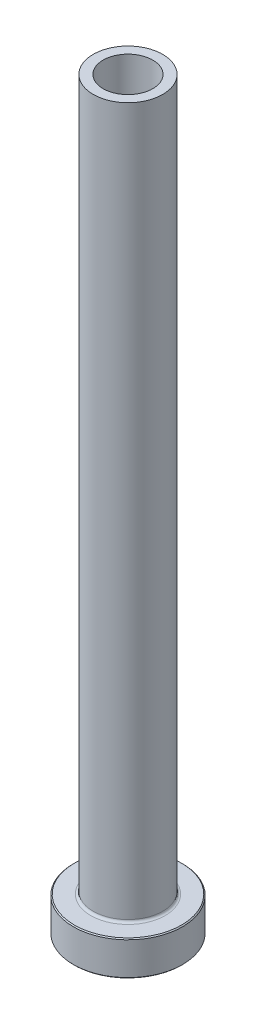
ISO-10303-21;
HEADER;
FILE_DESCRIPTION(('STEP AP214'),'2;1');
FILE_NAME('part.step','',(''),(''),'','','');
FILE_SCHEMA(('AUTOMOTIVE_DESIGN { 1 0 10303 214 1 1 1 1 }'));
ENDSEC;
DATA;
#1=APPLICATION_CONTEXT('core data for automotive mechanical design processes');
#2=APPLICATION_PROTOCOL_DEFINITION('international standard','automotive_design',2000,#1);
#3=PRODUCT_CONTEXT('',#1,'mechanical');
#4=PRODUCT('Part','Part','',(#3));
#5=PRODUCT_RELATED_PRODUCT_CATEGORY('part','',(#4));
#6=PRODUCT_DEFINITION_FORMATION('','',#4);
#7=PRODUCT_DEFINITION_CONTEXT('part definition',#1,'design');
#8=PRODUCT_DEFINITION('design','',#6,#7);
#9=PRODUCT_DEFINITION_SHAPE('','',#8);
#10=(LENGTH_UNIT() NAMED_UNIT(*) SI_UNIT(.MILLI.,.METRE.));
#11=(NAMED_UNIT(*) PLANE_ANGLE_UNIT() SI_UNIT($,.RADIAN.));
#12=(NAMED_UNIT(*) SI_UNIT($,.STERADIAN.) SOLID_ANGLE_UNIT());
#13=UNCERTAINTY_MEASURE_WITH_UNIT(LENGTH_MEASURE(1.E-05),#10,'distance_accuracy_value','');
#14=(GEOMETRIC_REPRESENTATION_CONTEXT(3) GLOBAL_UNCERTAINTY_ASSIGNED_CONTEXT((#13)) GLOBAL_UNIT_ASSIGNED_CONTEXT((#10,
#11,#12)) REPRESENTATION_CONTEXT('',''));
#15=CARTESIAN_POINT('',(0.,0.,0.));
#16=DIRECTION('',(0.,0.,1.));
#17=DIRECTION('',(1.,0.,0.));
#18=AXIS2_PLACEMENT_3D('',#15,#16,#17);
#19=CARTESIAN_POINT('',(0.,92.1876809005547,0.));
#20=DIRECTION('',(0.,1.,0.));
#21=DIRECTION('',(0.,0.,1.));
#22=AXIS2_PLACEMENT_3D('',#19,#20,#21);
#23=CYLINDRICAL_SURFACE('',#22,5.);
#24=CARTESIAN_POINT('',(0.,150.,0.));
#25=DIRECTION('',(0.,1.,0.));
#26=DIRECTION('',(0.,0.,1.));
#27=AXIS2_PLACEMENT_3D('',#24,#25,#26);
#28=CIRCLE('',#27,5.);
#29=CARTESIAN_POINT('',(0.,150.,5.));
#30=VERTEX_POINT('',#29);
#31=EDGE_CURVE('E62',#30,#30,#28,.T.);
#32=ORIENTED_EDGE('',*,*,#31,.T.);
#33=EDGE_LOOP('',(#32));
#34=FACE_BOUND('',#33,.T.);
#35=CARTESIAN_POINT('',(0.,105.,0.));
#36=DIRECTION('',(0.,1.,0.));
#37=DIRECTION('',(0.,0.,1.));
#38=AXIS2_PLACEMENT_3D('',#35,#36,#37);
#39=CIRCLE('',#38,5.);
#40=CARTESIAN_POINT('',(0.,105.,5.));
#41=VERTEX_POINT('',#40);
#42=EDGE_CURVE('E71',#41,#41,#39,.T.);
#43=ORIENTED_EDGE('',*,*,#42,.F.);
#44=EDGE_LOOP('',(#43));
#45=FACE_BOUND('',#44,.T.);
#46=ADVANCED_FACE('F30',(#34,#45),#23,.F.);
#47=CARTESIAN_POINT('',(-5.,150.,0.));
#48=DIRECTION('',(0.,1.,0.));
#49=DIRECTION('',(0.,0.,1.));
#50=AXIS2_PLACEMENT_3D('',#47,#48,#49);
#51=PLANE('',#50);
#52=CARTESIAN_POINT('',(0.,150.,0.));
#53=DIRECTION('',(0.,1.,0.));
#54=DIRECTION('',(0.,0.,1.));
#55=AXIS2_PLACEMENT_3D('',#52,#53,#54);
#56=CIRCLE('',#55,7.00000000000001);
#57=CARTESIAN_POINT('',(0.,150.,7.00000000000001));
#58=VERTEX_POINT('',#57);
#59=EDGE_CURVE('E65',#58,#58,#56,.T.);
#60=ORIENTED_EDGE('',*,*,#59,.T.);
#61=EDGE_LOOP('',(#60));
#62=FACE_BOUND('',#61,.T.);
#63=ORIENTED_EDGE('',*,*,#31,.F.);
#64=EDGE_LOOP('',(#63));
#65=FACE_BOUND('',#64,.T.);
#66=ADVANCED_FACE('F79',(#62,#65),#51,.T.);
#67=CARTESIAN_POINT('',(0.,92.1876809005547,0.));
#68=DIRECTION('',(0.,1.,0.));
#69=DIRECTION('',(0.,0.,1.));
#70=AXIS2_PLACEMENT_3D('',#67,#68,#69);
#71=CYLINDRICAL_SURFACE('',#70,7.);
#72=CARTESIAN_POINT('',(0.,7.50000000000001,0.));
#73=DIRECTION('',(0.,1.,0.));
#74=DIRECTION('',(0.,0.,1.));
#75=AXIS2_PLACEMENT_3D('',#72,#73,#74);
#76=CIRCLE('',#75,7.);
#77=CARTESIAN_POINT('',(0.,7.50000000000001,7.));
#78=VERTEX_POINT('',#77);
#79=EDGE_CURVE('E59',#78,#78,#76,.T.);
#80=ORIENTED_EDGE('',*,*,#79,.T.);
#81=EDGE_LOOP('',(#80));
#82=FACE_BOUND('',#81,.T.);
#83=ORIENTED_EDGE('',*,*,#59,.F.);
#84=EDGE_LOOP('',(#83));
#85=FACE_BOUND('',#84,.T.);
#86=ADVANCED_FACE('F85',(#82,#85),#71,.T.);
#87=CARTESIAN_POINT('',(-6.99999999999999,7.,0.));
#88=DIRECTION('',(0.,1.,0.));
#89=DIRECTION('',(0.,0.,1.));
#90=AXIS2_PLACEMENT_3D('',#87,#88,#89);
#91=PLANE('',#90);
#92=CARTESIAN_POINT('',(0.,7.,0.));
#93=DIRECTION('',(0.,1.,0.));
#94=DIRECTION('',(0.,0.,1.));
#95=AXIS2_PLACEMENT_3D('',#92,#93,#94);
#96=CIRCLE('',#95,10.8);
#97=CARTESIAN_POINT('',(0.,7.,10.8));
#98=VERTEX_POINT('',#97);
#99=EDGE_CURVE('E53',#98,#98,#96,.T.);
#100=ORIENTED_EDGE('',*,*,#99,.T.);
#101=EDGE_LOOP('',(#100));
#102=FACE_BOUND('',#101,.T.);
#103=CARTESIAN_POINT('',(0.,7.,0.));
#104=DIRECTION('',(0.,1.,0.));
#105=DIRECTION('',(0.,0.,1.));
#106=AXIS2_PLACEMENT_3D('',#103,#104,#105);
#107=CIRCLE('',#106,7.5);
#108=CARTESIAN_POINT('',(0.,7.,7.5));
#109=VERTEX_POINT('',#108);
#110=EDGE_CURVE('E56',#109,#109,#107,.F.);
#111=ORIENTED_EDGE('',*,*,#110,.T.);
#112=EDGE_LOOP('',(#111));
#113=FACE_BOUND('',#112,.T.);
#114=ADVANCED_FACE('F111',(#102,#113),#91,.T.);
#115=CARTESIAN_POINT('',(0.,92.1876809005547,0.));
#116=DIRECTION('',(0.,1.,0.));
#117=DIRECTION('',(0.,0.,1.));
#118=AXIS2_PLACEMENT_3D('',#115,#116,#117);
#119=CYLINDRICAL_SURFACE('',#118,11.);
#120=CARTESIAN_POINT('',(0.,6.79999999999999,0.));
#121=DIRECTION('',(0.,1.,0.));
#122=DIRECTION('',(0.,0.,1.));
#123=AXIS2_PLACEMENT_3D('',#120,#121,#122);
#124=CIRCLE('',#123,11.);
#125=CARTESIAN_POINT('',(0.,6.79999999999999,11.));
#126=VERTEX_POINT('',#125);
#127=EDGE_CURVE('E45',#126,#126,#124,.F.);
#128=ORIENTED_EDGE('',*,*,#127,.T.);
#129=EDGE_LOOP('',(#128));
#130=FACE_BOUND('',#129,.T.);
#131=CARTESIAN_POINT('',(0.,0.200000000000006,0.));
#132=DIRECTION('',(0.,-1.,0.));
#133=DIRECTION('',(0.,0.,-1.));
#134=AXIS2_PLACEMENT_3D('',#131,#132,#133);
#135=CIRCLE('',#134,11.);
#136=CARTESIAN_POINT('',(0.,0.200000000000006,-11.));
#137=VERTEX_POINT('',#136);
#138=EDGE_CURVE('E50',#137,#137,#135,.F.);
#139=ORIENTED_EDGE('',*,*,#138,.T.);
#140=EDGE_LOOP('',(#139));
#141=FACE_BOUND('',#140,.T.);
#142=ADVANCED_FACE('F108',(#130,#141),#119,.T.);
#143=CARTESIAN_POINT('',(-11.,0.,0.));
#144=DIRECTION('',(0.,-1.,0.));
#145=DIRECTION('',(0.,0.,-1.));
#146=AXIS2_PLACEMENT_3D('',#143,#144,#145);
#147=PLANE('',#146);
#148=CARTESIAN_POINT('',(0.,0.,0.));
#149=DIRECTION('',(0.,-1.,0.));
#150=DIRECTION('',(0.,0.,-1.));
#151=AXIS2_PLACEMENT_3D('',#148,#149,#150);
#152=CIRCLE('',#151,5.75000000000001);
#153=CARTESIAN_POINT('',(0.,0.,-5.75000000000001));
#154=VERTEX_POINT('',#153);
#155=EDGE_CURVE('E37',#154,#154,#152,.F.);
#156=ORIENTED_EDGE('',*,*,#155,.T.);
#157=EDGE_LOOP('',(#156));
#158=FACE_BOUND('',#157,.T.);
#159=CARTESIAN_POINT('',(0.,0.,0.));
#160=DIRECTION('',(0.,-1.,0.));
#161=DIRECTION('',(0.,0.,-1.));
#162=AXIS2_PLACEMENT_3D('',#159,#160,#161);
#163=CIRCLE('',#162,10.8);
#164=CARTESIAN_POINT('',(0.,0.,-10.8));
#165=VERTEX_POINT('',#164);
#166=EDGE_CURVE('E41',#165,#165,#163,.T.);
#167=ORIENTED_EDGE('',*,*,#166,.T.);
#168=EDGE_LOOP('',(#167));
#169=FACE_BOUND('',#168,.T.);
#170=ADVANCED_FACE('F110',(#158,#169),#147,.T.);
#171=CARTESIAN_POINT('',(0.,92.1876809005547,0.));
#172=DIRECTION('',(0.,1.,0.));
#173=DIRECTION('',(0.,0.,1.));
#174=AXIS2_PLACEMENT_3D('',#171,#172,#173);
#175=CYLINDRICAL_SURFACE('',#174,5.25);
#176=CARTESIAN_POINT('',(0.,0.5,0.));
#177=DIRECTION('',(0.,-1.,0.));
#178=DIRECTION('',(0.,0.,-1.));
#179=AXIS2_PLACEMENT_3D('',#176,#177,#178);
#180=CIRCLE('',#179,5.25);
#181=CARTESIAN_POINT('',(0.,0.5,-5.25));
#182=VERTEX_POINT('',#181);
#183=EDGE_CURVE('E10',#182,#182,#180,.T.);
#184=ORIENTED_EDGE('',*,*,#183,.T.);
#185=EDGE_LOOP('',(#184));
#186=FACE_BOUND('',#185,.T.);
#187=CARTESIAN_POINT('',(0.,93.,0.));
#188=DIRECTION('',(0.,1.,0.));
#189=DIRECTION('',(0.,0.,1.));
#190=AXIS2_PLACEMENT_3D('',#187,#188,#189);
#191=CIRCLE('',#190,5.25);
#192=CARTESIAN_POINT('',(0.,93.,5.25));
#193=VERTEX_POINT('',#192);
#194=EDGE_CURVE('E68',#193,#193,#191,.T.);
#195=ORIENTED_EDGE('',*,*,#194,.T.);
#196=EDGE_LOOP('',(#195));
#197=FACE_BOUND('',#196,.T.);
#198=ADVANCED_FACE('F118',(#186,#197),#175,.F.);
#199=CARTESIAN_POINT('',(0.,93.,0.));
#200=DIRECTION('',(0.,-1.,0.));
#201=DIRECTION('',(0.,0.,-1.));
#202=AXIS2_PLACEMENT_3D('',#199,#200,#201);
#203=CONICAL_SURFACE('',#202,5.25,0.0208303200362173);
#204=ORIENTED_EDGE('',*,*,#42,.T.);
#205=EDGE_LOOP('',(#204));
#206=FACE_BOUND('',#205,.T.);
#207=ORIENTED_EDGE('',*,*,#194,.F.);
#208=EDGE_LOOP('',(#207));
#209=FACE_BOUND('',#208,.T.);
#210=ADVANCED_FACE('F75',(#206,#209),#203,.F.);
#211=CARTESIAN_POINT('',(0.,7.50000000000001,0.));
#212=DIRECTION('',(0.,1.,0.));
#213=DIRECTION('',(0.,0.,1.));
#214=AXIS2_PLACEMENT_3D('',#211,#212,#213);
#215=TOROIDAL_SURFACE('',#214,7.5,0.5);
#216=ORIENTED_EDGE('',*,*,#110,.F.);
#217=EDGE_LOOP('',(#216));
#218=FACE_BOUND('',#217,.T.);
#219=ORIENTED_EDGE('',*,*,#79,.F.);
#220=EDGE_LOOP('',(#219));
#221=FACE_BOUND('',#220,.T.);
#222=ADVANCED_FACE('F90',(#218,#221),#215,.F.);
#223=CARTESIAN_POINT('',(0.,7.00000000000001,0.));
#224=DIRECTION('',(0.,-1.,0.));
#225=DIRECTION('',(0.,0.,-1.));
#226=AXIS2_PLACEMENT_3D('',#223,#224,#225);
#227=CONICAL_SURFACE('',#226,10.8,0.785398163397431);
#228=ORIENTED_EDGE('',*,*,#127,.F.);
#229=EDGE_LOOP('',(#228));
#230=FACE_BOUND('',#229,.T.);
#231=ORIENTED_EDGE('',*,*,#99,.F.);
#232=EDGE_LOOP('',(#231));
#233=FACE_BOUND('',#232,.T.);
#234=ADVANCED_FACE('F93',(#230,#233),#227,.T.);
#235=CARTESIAN_POINT('',(0.,0.200000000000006,0.));
#236=DIRECTION('',(0.,1.,0.));
#237=DIRECTION('',(0.,0.,1.));
#238=AXIS2_PLACEMENT_3D('',#235,#236,#237);
#239=CONICAL_SURFACE('',#238,11.,0.785398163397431);
#240=ORIENTED_EDGE('',*,*,#166,.F.);
#241=EDGE_LOOP('',(#240));
#242=FACE_BOUND('',#241,.T.);
#243=ORIENTED_EDGE('',*,*,#138,.F.);
#244=EDGE_LOOP('',(#243));
#245=FACE_BOUND('',#244,.T.);
#246=ADVANCED_FACE('F96',(#242,#245),#239,.T.);
#247=CARTESIAN_POINT('',(0.,0.,0.));
#248=DIRECTION('',(0.,-1.,0.));
#249=DIRECTION('',(0.,0.,-1.));
#250=AXIS2_PLACEMENT_3D('',#247,#248,#249);
#251=CONICAL_SURFACE('',#250,5.75000000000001,0.785398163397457);
#252=ORIENTED_EDGE('',*,*,#183,.F.);
#253=EDGE_LOOP('',(#252));
#254=FACE_BOUND('',#253,.T.);
#255=ORIENTED_EDGE('',*,*,#155,.F.);
#256=EDGE_LOOP('',(#255));
#257=FACE_BOUND('',#256,.T.);
#258=ADVANCED_FACE('F32',(#254,#257),#251,.F.);
#259=CLOSED_SHELL('',(#46,#66,#86,#114,#142,#170,#198,#210,#222,#234,#246,#258));
#260=MANIFOLD_SOLID_BREP('B2',#259);
#261=ADVANCED_BREP_SHAPE_REPRESENTATION('',(#18,#260),#14);
#262=SHAPE_DEFINITION_REPRESENTATION(#9,#261);
ENDSEC;
END-ISO-10303-21;
